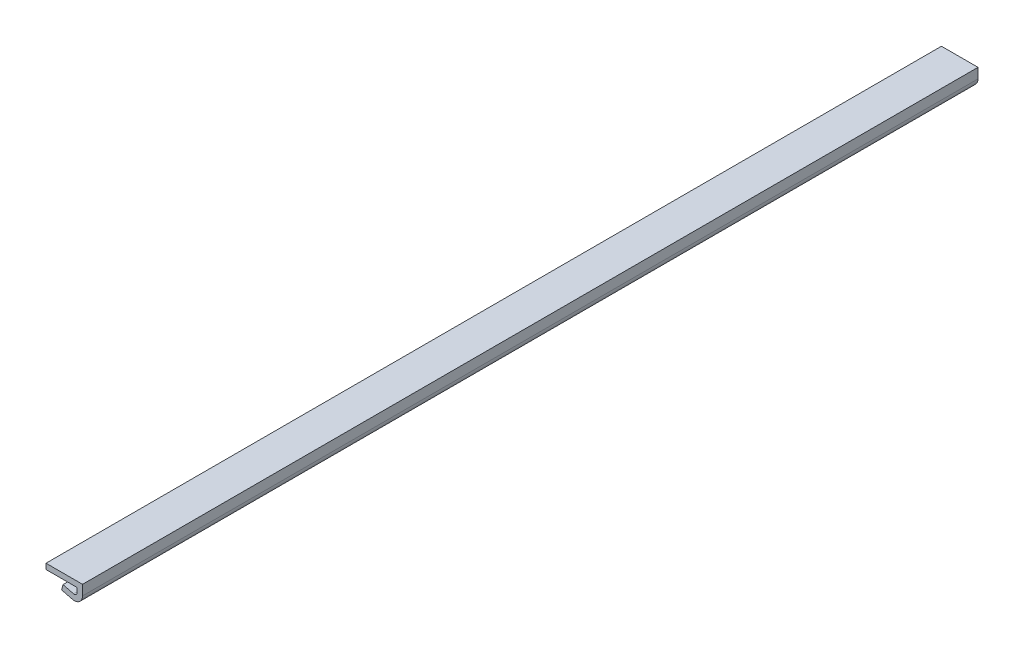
from build123d import *

# Parameters (mm, degrees)
EXTRUSION1_DEPTH = 490


with BuildPart() as part:
    # Esquisse1 → Extrusion1 (new body)
    with BuildSketch(Plane.XY):
        with BuildLine():
            Line((0, 0), (20, 0))
            Line((20, 0), (20, -5.5))
            ThreePointArc((20, -5.5), (18.270476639, -9.046048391), (14.41135147, -9.866330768))
            Line((14.41135147, -9.866330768), (8.573886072, -8.410887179))
            Line((8.573886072, -8.410887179), (9.299651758, -5.5))
            Line((9.299651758, -5.5), (15.137117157, -6.955443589))
            ThreePointArc((15.137117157, -6.955443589), (16.423492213, -6.68201613), (17, -5.5))
            Line((17, -5.5), (17, -3))
            Line((17, -3), (0, -3))
            Line((0, -3), (0, 0))
        make_face()
    extrude(amount=EXTRUSION1_DEPTH)


solid = part.part
